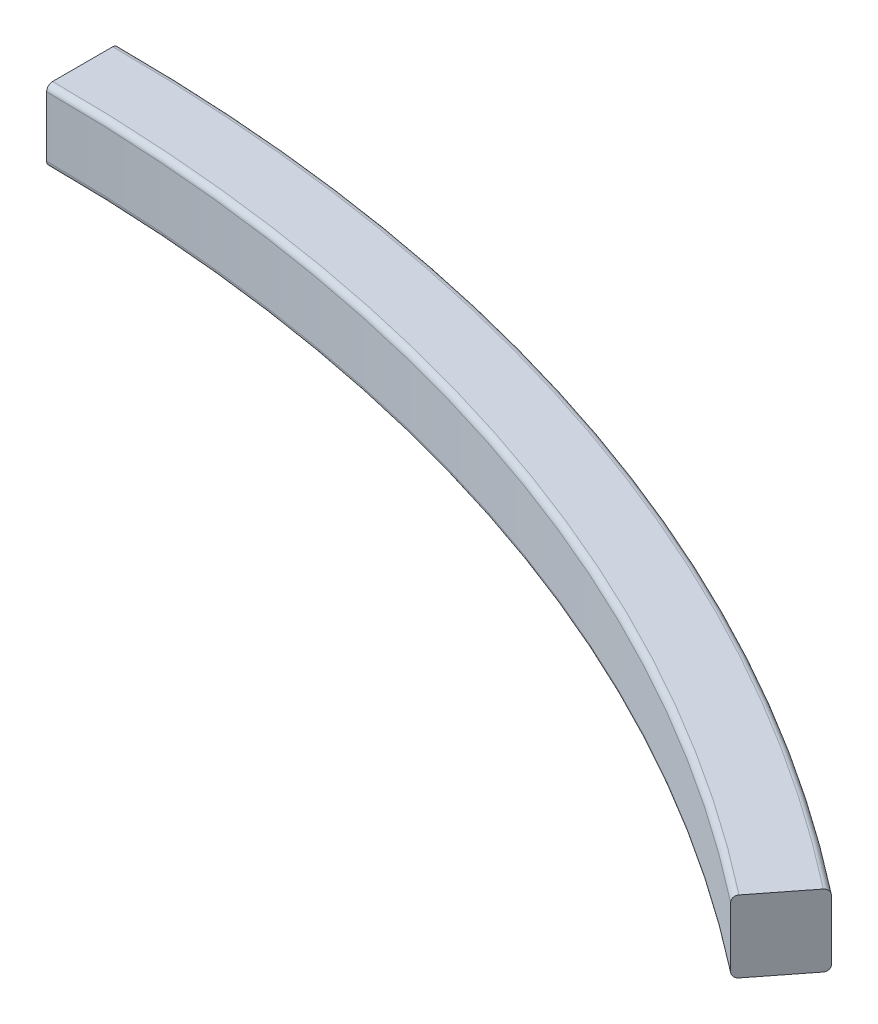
ISO-10303-21;
HEADER;
FILE_DESCRIPTION(('STEP AP214'),'2;1');
FILE_NAME('part.step','',(''),(''),'','','');
FILE_SCHEMA(('AUTOMOTIVE_DESIGN { 1 0 10303 214 1 1 1 1 }'));
ENDSEC;
DATA;
#1=APPLICATION_CONTEXT('core data for automotive mechanical design processes');
#2=APPLICATION_PROTOCOL_DEFINITION('international standard','automotive_design',2000,#1);
#3=PRODUCT_CONTEXT('',#1,'mechanical');
#4=PRODUCT('Part','Part','',(#3));
#5=PRODUCT_RELATED_PRODUCT_CATEGORY('part','',(#4));
#6=PRODUCT_DEFINITION_FORMATION('','',#4);
#7=PRODUCT_DEFINITION_CONTEXT('part definition',#1,'design');
#8=PRODUCT_DEFINITION('design','',#6,#7);
#9=PRODUCT_DEFINITION_SHAPE('','',#8);
#10=(LENGTH_UNIT() NAMED_UNIT(*) SI_UNIT(.MILLI.,.METRE.));
#11=(NAMED_UNIT(*) PLANE_ANGLE_UNIT() SI_UNIT($,.RADIAN.));
#12=(NAMED_UNIT(*) SI_UNIT($,.STERADIAN.) SOLID_ANGLE_UNIT());
#13=UNCERTAINTY_MEASURE_WITH_UNIT(LENGTH_MEASURE(1.E-05),#10,'distance_accuracy_value','');
#14=(GEOMETRIC_REPRESENTATION_CONTEXT(3) GLOBAL_UNCERTAINTY_ASSIGNED_CONTEXT((#13)) GLOBAL_UNIT_ASSIGNED_CONTEXT((#10,
#11,#12)) REPRESENTATION_CONTEXT('',''));
#15=CARTESIAN_POINT('',(0.,0.,0.));
#16=DIRECTION('',(0.,0.,1.));
#17=DIRECTION('',(1.,0.,0.));
#18=AXIS2_PLACEMENT_3D('',#15,#16,#17);
#19=CARTESIAN_POINT('',(0.,5.07999999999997,1500.));
#20=DIRECTION('',(0.,1.,0.));
#21=DIRECTION('',(0.,0.,1.));
#22=AXIS2_PLACEMENT_3D('',#19,#20,#21);
#23=TOROIDAL_SURFACE('',#22,1473.965,5.08);
#24=CARTESIAN_POINT('',(0.,0.,1500.));
#25=DIRECTION('',(0.,1.,0.));
#26=DIRECTION('',(0.,0.,1.));
#27=AXIS2_PLACEMENT_3D('',#24,#25,#26);
#28=CIRCLE('',#27,1473.965);
#29=CARTESIAN_POINT('',(908.52745863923,0.,339.331796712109));
#30=VERTEX_POINT('',#29);
#31=CARTESIAN_POINT('',(0.,0.,26.035));
#32=VERTEX_POINT('',#31);
#33=EDGE_CURVE('E12',#30,#32,#28,.T.);
#34=ORIENTED_EDGE('',*,*,#33,.F.);
#35=CARTESIAN_POINT('',(908.52745863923,5.07999999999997,339.331796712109));
#36=DIRECTION('',(0.787446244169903,0.,0.616383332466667));
#37=DIRECTION('',(0.616383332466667,0.,-0.787446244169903));
#38=AXIS2_PLACEMENT_3D('',#35,#36,#37);
#39=CIRCLE('',#38,5.08);
#40=CARTESIAN_POINT('',(905.3962313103,5.07999999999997,343.332023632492));
#41=VERTEX_POINT('',#40);
#42=EDGE_CURVE('E132',#41,#30,#39,.T.);
#43=ORIENTED_EDGE('',*,*,#42,.F.);
#44=CARTESIAN_POINT('',(0.,5.07999999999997,1500.));
#45=DIRECTION('',(0.,1.,0.));
#46=DIRECTION('',(0.,0.,1.));
#47=AXIS2_PLACEMENT_3D('',#44,#45,#46);
#48=CIRCLE('',#47,1468.885);
#49=CARTESIAN_POINT('',(0.,5.07999999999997,31.115));
#50=VERTEX_POINT('',#49);
#51=EDGE_CURVE('E48',#41,#50,#48,.T.);
#52=ORIENTED_EDGE('',*,*,#51,.T.);
#53=CARTESIAN_POINT('',(0.,5.07999999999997,26.0349999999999));
#54=DIRECTION('',(1.,0.,0.));
#55=DIRECTION('',(0.,0.,-1.));
#56=AXIS2_PLACEMENT_3D('',#53,#54,#55);
#57=CIRCLE('',#56,5.08);
#58=EDGE_CURVE('E108',#50,#32,#57,.T.);
#59=ORIENTED_EDGE('',*,*,#58,.T.);
#60=EDGE_LOOP('',(#34,#43,#52,#59));
#61=FACE_BOUND('',#60,.T.);
#62=ADVANCED_FACE('F33',(#61),#23,.T.);
#63=CARTESIAN_POINT('',(908.52745863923,0.,339.331796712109));
#64=DIRECTION('',(0.,1.,0.));
#65=DIRECTION('',(0.,0.,1.));
#66=AXIS2_PLACEMENT_3D('',#63,#64,#65);
#67=PLANE('',#66);
#68=CARTESIAN_POINT('',(0.,0.,1500.));
#69=DIRECTION('',(0.,1.,0.));
#70=DIRECTION('',(0.,0.,1.));
#71=AXIS2_PLACEMENT_3D('',#68,#69,#70);
#72=CIRCLE('',#71,1526.035);
#73=CARTESIAN_POINT('',(940.62253876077,0.,298.329470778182));
#74=VERTEX_POINT('',#73);
#75=CARTESIAN_POINT('',(0.,0.,-26.035));
#76=VERTEX_POINT('',#75);
#77=EDGE_CURVE('E41',#74,#76,#72,.T.);
#78=ORIENTED_EDGE('',*,*,#77,.F.);
#79=DIRECTION('',(0.616383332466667,0.,-0.787446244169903));
#80=VECTOR('',#79,1.);
#81=CARTESIAN_POINT('',(908.52745863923,0.,339.331796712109));
#82=LINE('',#81,#80);
#83=EDGE_CURVE('E104',#30,#74,#82,.T.);
#84=ORIENTED_EDGE('',*,*,#83,.F.);
#85=ORIENTED_EDGE('',*,*,#33,.T.);
#86=DIRECTION('',(0.,0.,-1.));
#87=VECTOR('',#86,1.);
#88=CARTESIAN_POINT('',(0.,0.,26.035));
#89=LINE('',#88,#87);
#90=EDGE_CURVE('E101',#32,#76,#89,.T.);
#91=ORIENTED_EDGE('',*,*,#90,.T.);
#92=EDGE_LOOP('',(#78,#84,#85,#91));
#93=FACE_BOUND('',#92,.T.);
#94=ADVANCED_FACE('F35',(#93),#67,.F.);
#95=CARTESIAN_POINT('',(0.,5.07999999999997,1500.));
#96=DIRECTION('',(0.,1.,0.));
#97=DIRECTION('',(0.,0.,1.));
#98=AXIS2_PLACEMENT_3D('',#95,#96,#97);
#99=TOROIDAL_SURFACE('',#98,1526.035,5.07999999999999);
#100=CARTESIAN_POINT('',(0.,5.08,1500.));
#101=DIRECTION('',(0.,1.,0.));
#102=DIRECTION('',(0.,0.,1.));
#103=AXIS2_PLACEMENT_3D('',#100,#101,#102);
#104=CIRCLE('',#103,1531.115);
#105=CARTESIAN_POINT('',(943.7537660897,5.08,294.329243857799));
#106=VERTEX_POINT('',#105);
#107=CARTESIAN_POINT('',(0.,5.08,-31.115));
#108=VERTEX_POINT('',#107);
#109=EDGE_CURVE('E160',#106,#108,#104,.T.);
#110=ORIENTED_EDGE('',*,*,#109,.F.);
#111=CARTESIAN_POINT('',(940.62253876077,5.07999999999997,298.329470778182));
#112=DIRECTION('',(0.787446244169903,0.,0.616383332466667));
#113=DIRECTION('',(-0.616383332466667,0.,0.787446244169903));
#114=AXIS2_PLACEMENT_3D('',#111,#112,#113);
#115=CIRCLE('',#114,5.07999999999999);
#116=EDGE_CURVE('E135',#74,#106,#115,.T.);
#117=ORIENTED_EDGE('',*,*,#116,.F.);
#118=ORIENTED_EDGE('',*,*,#77,.T.);
#119=CARTESIAN_POINT('',(0.,5.07999999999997,-26.035));
#120=DIRECTION('',(1.,0.,0.));
#121=DIRECTION('',(0.,0.,1.));
#122=AXIS2_PLACEMENT_3D('',#119,#120,#121);
#123=CIRCLE('',#122,5.07999999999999);
#124=EDGE_CURVE('E115',#76,#108,#123,.T.);
#125=ORIENTED_EDGE('',*,*,#124,.T.);
#126=EDGE_LOOP('',(#110,#117,#118,#125));
#127=FACE_BOUND('',#126,.T.);
#128=ADVANCED_FACE('F163',(#127),#99,.T.);
#129=CARTESIAN_POINT('',(0.,0.,1500.));
#130=DIRECTION('',(0.,1.,0.));
#131=DIRECTION('',(0.,0.,1.));
#132=AXIS2_PLACEMENT_3D('',#129,#130,#131);
#133=CYLINDRICAL_SURFACE('',#132,1531.115);
#134=CARTESIAN_POINT('',(0.,57.4039999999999,1500.));
#135=DIRECTION('',(0.,1.,0.));
#136=DIRECTION('',(0.,0.,1.));
#137=AXIS2_PLACEMENT_3D('',#134,#135,#136);
#138=CIRCLE('',#137,1531.115);
#139=CARTESIAN_POINT('',(943.7537660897,57.4039999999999,294.329243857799));
#140=VERTEX_POINT('',#139);
#141=CARTESIAN_POINT('',(0.,57.4039999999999,-31.115));
#142=VERTEX_POINT('',#141);
#143=EDGE_CURVE('E158',#140,#142,#138,.T.);
#144=ORIENTED_EDGE('',*,*,#143,.F.);
#145=DIRECTION('',(0.,1.,0.));
#146=VECTOR('',#145,1.);
#147=CARTESIAN_POINT('',(943.7537660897,5.08,294.329243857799));
#148=LINE('',#147,#146);
#149=EDGE_CURVE('E138',#106,#140,#148,.T.);
#150=ORIENTED_EDGE('',*,*,#149,.F.);
#151=ORIENTED_EDGE('',*,*,#109,.T.);
#152=DIRECTION('',(0.,1.,0.));
#153=VECTOR('',#152,1.);
#154=CARTESIAN_POINT('',(0.,5.08,-31.115));
#155=LINE('',#154,#153);
#156=EDGE_CURVE('E117',#108,#142,#155,.T.);
#157=ORIENTED_EDGE('',*,*,#156,.T.);
#158=EDGE_LOOP('',(#144,#150,#151,#157));
#159=FACE_BOUND('',#158,.T.);
#160=ADVANCED_FACE('F179',(#159),#133,.T.);
#161=CARTESIAN_POINT('',(0.,57.4039999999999,1500.));
#162=DIRECTION('',(0.,1.,0.));
#163=DIRECTION('',(0.,0.,1.));
#164=AXIS2_PLACEMENT_3D('',#161,#162,#163);
#165=TOROIDAL_SURFACE('',#164,1526.162,4.95300000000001);
#166=CARTESIAN_POINT('',(0.,62.3569999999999,1500.));
#167=DIRECTION('',(0.,1.,0.));
#168=DIRECTION('',(0.,0.,1.));
#169=AXIS2_PLACEMENT_3D('',#166,#167,#168);
#170=CIRCLE('',#169,1526.162);
#171=CARTESIAN_POINT('',(940.700819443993,62.3569999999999,298.229465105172));
#172=VERTEX_POINT('',#171);
#173=CARTESIAN_POINT('',(0.,62.3569999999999,-26.1619999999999));
#174=VERTEX_POINT('',#173);
#175=EDGE_CURVE('E156',#172,#174,#170,.T.);
#176=ORIENTED_EDGE('',*,*,#175,.F.);
#177=CARTESIAN_POINT('',(940.700819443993,57.4039999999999,298.229465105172));
#178=DIRECTION('',(0.787446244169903,0.,0.616383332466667));
#179=DIRECTION('',(-0.616383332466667,0.,0.787446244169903));
#180=AXIS2_PLACEMENT_3D('',#177,#178,#179);
#181=CIRCLE('',#180,4.95300000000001);
#182=EDGE_CURVE('E141',#140,#172,#181,.T.);
#183=ORIENTED_EDGE('',*,*,#182,.F.);
#184=ORIENTED_EDGE('',*,*,#143,.T.);
#185=CARTESIAN_POINT('',(0.,57.4039999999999,-26.1619999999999));
#186=DIRECTION('',(1.,0.,0.));
#187=DIRECTION('',(0.,0.,1.));
#188=AXIS2_PLACEMENT_3D('',#185,#186,#187);
#189=CIRCLE('',#188,4.95300000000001);
#190=EDGE_CURVE('E122',#142,#174,#189,.T.);
#191=ORIENTED_EDGE('',*,*,#190,.T.);
#192=EDGE_LOOP('',(#176,#183,#184,#191));
#193=FACE_BOUND('',#192,.T.);
#194=ADVANCED_FACE('F177',(#193),#165,.T.);
#195=CARTESIAN_POINT('',(908.605739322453,62.3569999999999,339.231791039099));
#196=DIRECTION('',(0.,-1.,0.));
#197=DIRECTION('',(0.,0.,-1.));
#198=AXIS2_PLACEMENT_3D('',#195,#196,#197);
#199=PLANE('',#198);
#200=CARTESIAN_POINT('',(0.,62.3569999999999,1500.));
#201=DIRECTION('',(0.,1.,0.));
#202=DIRECTION('',(0.,0.,1.));
#203=AXIS2_PLACEMENT_3D('',#200,#201,#202);
#204=CIRCLE('',#203,1474.092);
#205=CARTESIAN_POINT('',(908.605739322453,62.3569999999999,339.231791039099));
#206=VERTEX_POINT('',#205);
#207=CARTESIAN_POINT('',(0.,62.3569999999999,25.908));
#208=VERTEX_POINT('',#207);
#209=EDGE_CURVE('E154',#206,#208,#204,.T.);
#210=ORIENTED_EDGE('',*,*,#209,.F.);
#211=DIRECTION('',(-0.616383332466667,0.,0.787446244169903));
#212=VECTOR('',#211,1.);
#213=CARTESIAN_POINT('',(908.605739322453,62.3569999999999,339.231791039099));
#214=LINE('',#213,#212);
#215=EDGE_CURVE('E144',#172,#206,#214,.T.);
#216=ORIENTED_EDGE('',*,*,#215,.F.);
#217=ORIENTED_EDGE('',*,*,#175,.T.);
#218=DIRECTION('',(0.,0.,1.));
#219=VECTOR('',#218,1.);
#220=CARTESIAN_POINT('',(0.,62.3569999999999,25.908));
#221=LINE('',#220,#219);
#222=EDGE_CURVE('E125',#174,#208,#221,.T.);
#223=ORIENTED_EDGE('',*,*,#222,.T.);
#224=EDGE_LOOP('',(#210,#216,#217,#223));
#225=FACE_BOUND('',#224,.T.);
#226=ADVANCED_FACE('F173',(#225),#199,.F.);
#227=CARTESIAN_POINT('',(0.,57.1499999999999,1500.));
#228=DIRECTION('',(0.,1.,0.));
#229=DIRECTION('',(0.,0.,1.));
#230=AXIS2_PLACEMENT_3D('',#227,#228,#229);
#231=TOROIDAL_SURFACE('',#230,1474.092,5.207);
#232=CARTESIAN_POINT('',(0.,57.1499999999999,1500.));
#233=DIRECTION('',(0.,1.,0.));
#234=DIRECTION('',(0.,0.,1.));
#235=AXIS2_PLACEMENT_3D('',#232,#233,#234);
#236=CIRCLE('',#235,1468.885);
#237=CARTESIAN_POINT('',(905.3962313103,57.1499999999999,343.332023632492));
#238=VERTEX_POINT('',#237);
#239=CARTESIAN_POINT('',(0.,57.1499999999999,31.115));
#240=VERTEX_POINT('',#239);
#241=EDGE_CURVE('E56',#238,#240,#236,.T.);
#242=ORIENTED_EDGE('',*,*,#241,.F.);
#243=CARTESIAN_POINT('',(908.605739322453,57.1499999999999,339.231791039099));
#244=DIRECTION('',(0.787446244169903,0.,0.616383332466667));
#245=DIRECTION('',(0.616383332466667,0.,-0.787446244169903));
#246=AXIS2_PLACEMENT_3D('',#243,#244,#245);
#247=CIRCLE('',#246,5.207);
#248=EDGE_CURVE('E147',#206,#238,#247,.T.);
#249=ORIENTED_EDGE('',*,*,#248,.F.);
#250=ORIENTED_EDGE('',*,*,#209,.T.);
#251=CARTESIAN_POINT('',(0.,57.1499999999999,25.908));
#252=DIRECTION('',(1.,0.,0.));
#253=DIRECTION('',(0.,0.,-1.));
#254=AXIS2_PLACEMENT_3D('',#251,#252,#253);
#255=CIRCLE('',#254,5.207);
#256=EDGE_CURVE('E128',#208,#240,#255,.T.);
#257=ORIENTED_EDGE('',*,*,#256,.T.);
#258=EDGE_LOOP('',(#242,#249,#250,#257));
#259=FACE_BOUND('',#258,.T.);
#260=ADVANCED_FACE('F169',(#259),#231,.T.);
#261=CARTESIAN_POINT('',(0.,0.,1500.));
#262=DIRECTION('',(0.,1.,0.));
#263=DIRECTION('',(0.,0.,1.));
#264=AXIS2_PLACEMENT_3D('',#261,#262,#263);
#265=CYLINDRICAL_SURFACE('',#264,1468.885);
#266=DIRECTION('',(0.,-1.,0.));
#267=VECTOR('',#266,1.);
#268=CARTESIAN_POINT('',(905.3962313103,5.07999999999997,343.332023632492));
#269=LINE('',#268,#267);
#270=EDGE_CURVE('E149',#238,#41,#269,.T.);
#271=ORIENTED_EDGE('',*,*,#270,.F.);
#272=ORIENTED_EDGE('',*,*,#241,.T.);
#273=DIRECTION('',(0.,-1.,0.));
#274=VECTOR('',#273,1.);
#275=CARTESIAN_POINT('',(0.,5.07999999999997,31.115));
#276=LINE('',#275,#274);
#277=EDGE_CURVE('E130',#240,#50,#276,.T.);
#278=ORIENTED_EDGE('',*,*,#277,.T.);
#279=ORIENTED_EDGE('',*,*,#51,.F.);
#280=EDGE_LOOP('',(#271,#272,#278,#279));
#281=FACE_BOUND('',#280,.T.);
#282=ADVANCED_FACE('F167',(#281),#265,.F.);
#283=CARTESIAN_POINT('',(908.52745863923,5.07999999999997,339.331796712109));
#284=DIRECTION('',(0.787446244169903,0.,0.616383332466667));
#285=DIRECTION('',(0.616383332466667,0.,-0.787446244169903));
#286=AXIS2_PLACEMENT_3D('',#283,#284,#285);
#287=PLANE('',#286);
#288=ORIENTED_EDGE('',*,*,#42,.T.);
#289=ORIENTED_EDGE('',*,*,#83,.T.);
#290=ORIENTED_EDGE('',*,*,#116,.T.);
#291=ORIENTED_EDGE('',*,*,#149,.T.);
#292=ORIENTED_EDGE('',*,*,#182,.T.);
#293=ORIENTED_EDGE('',*,*,#215,.T.);
#294=ORIENTED_EDGE('',*,*,#248,.T.);
#295=ORIENTED_EDGE('',*,*,#270,.T.);
#296=EDGE_LOOP('',(#288,#289,#290,#291,#292,#293,#294,#295));
#297=FACE_BOUND('',#296,.T.);
#298=ADVANCED_FACE('F165',(#297),#287,.T.);
#299=CARTESIAN_POINT('',(0.,5.07999999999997,26.0349999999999));
#300=DIRECTION('',(1.,0.,0.));
#301=DIRECTION('',(0.,0.,-1.));
#302=AXIS2_PLACEMENT_3D('',#299,#300,#301);
#303=PLANE('',#302);
#304=ORIENTED_EDGE('',*,*,#58,.F.);
#305=ORIENTED_EDGE('',*,*,#277,.F.);
#306=ORIENTED_EDGE('',*,*,#256,.F.);
#307=ORIENTED_EDGE('',*,*,#222,.F.);
#308=ORIENTED_EDGE('',*,*,#190,.F.);
#309=ORIENTED_EDGE('',*,*,#156,.F.);
#310=ORIENTED_EDGE('',*,*,#124,.F.);
#311=ORIENTED_EDGE('',*,*,#90,.F.);
#312=EDGE_LOOP('',(#304,#305,#306,#307,#308,#309,#310,#311));
#313=FACE_BOUND('',#312,.T.);
#314=ADVANCED_FACE('F112',(#313),#303,.F.);
#315=CLOSED_SHELL('',(#62,#94,#128,#160,#194,#226,#260,#282,#298,#314));
#316=MANIFOLD_SOLID_BREP('B2',#315);
#317=ADVANCED_BREP_SHAPE_REPRESENTATION('',(#18,#316),#14);
#318=SHAPE_DEFINITION_REPRESENTATION(#9,#317);
ENDSEC;
END-ISO-10303-21;
